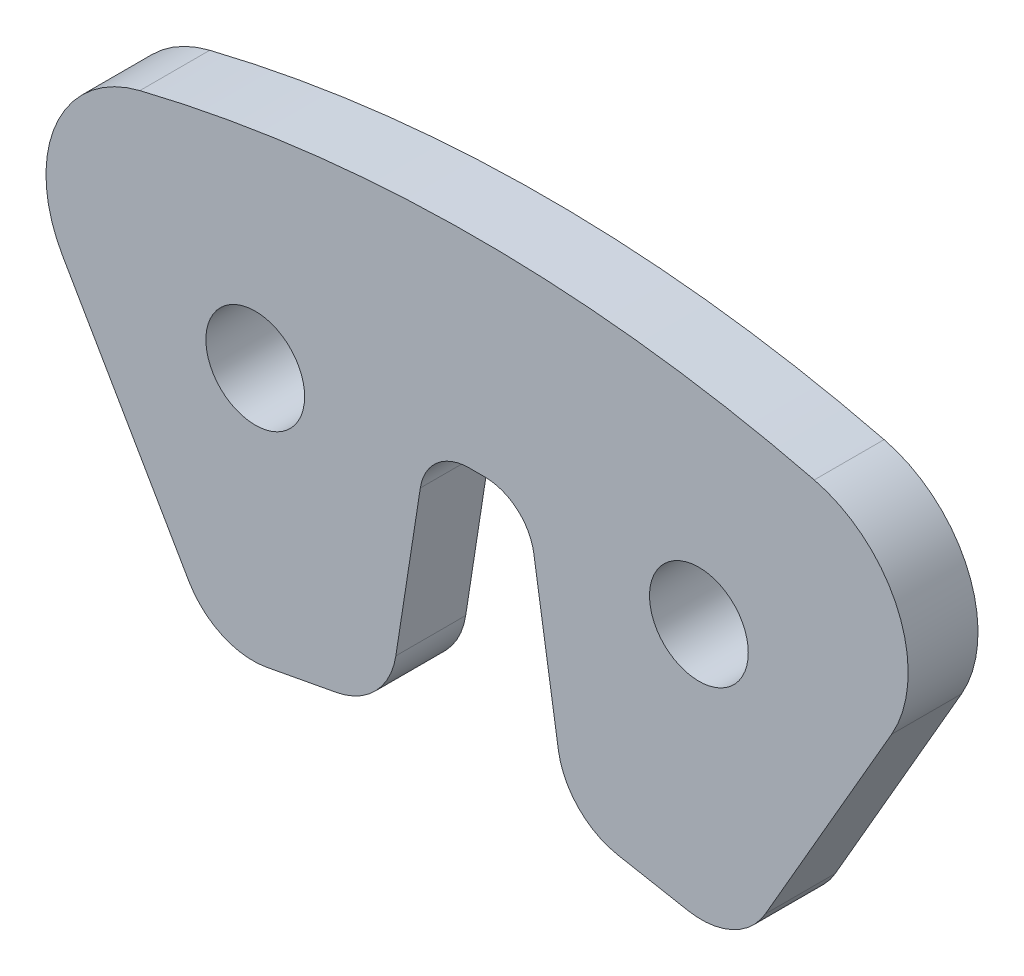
from build123d import *

# Parameters (mm, degrees)
SKETCH_2_R      = 1.06
EXTRUDE_1_DEPTH = 0.75
FILLET_1_R      = 2.65
FILLET_2_R      = 1.59
FILLET_3_R      = 1.06


with BuildPart() as part:
    # Sketch 2 → Extrude 1 (new, symmetric)
    with BuildSketch(Plane.XY):
        with BuildLine():
            Line((1.916731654, 20.523889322), (5.626784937, 19.830360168))
            Line((5.626784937, 19.830360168), (8.119880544, 24.148528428))
            Line((8.119880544, 24.148528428), (10.560448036, 28.375715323))
            ThreePointArc((10.560448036, 28.375715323), (0, 30.277124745), (-10.560448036, 28.375715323))
            Line((-10.560448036, 28.375715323), (-5.626784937, 19.830360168))
            Line((-5.626784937, 19.830360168), (-1.916731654, 20.523889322))
            Line((-1.916731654, 20.523889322), (-1.082856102, 25.895804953))
            ThreePointArc((-1.082856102, 25.895804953), (0, 25.91843536), (1.082856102, 25.895804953))
            Line((1.082856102, 25.895804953), (1.916731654, 20.523889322))
        make_face()
        with Locations((-4.7625, 25.477124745)):
            Circle(SKETCH_2_R, mode=Mode.SUBTRACT)
        with Locations((4.7625, 25.477124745)):
            Circle(SKETCH_2_R, mode=Mode.SUBTRACT)
    extrude(amount=EXTRUDE_1_DEPTH, both=True)

    # Fillet 1
    fillet_1_edges = [part.edges().sort_by_distance(p)[0] for p in [
        (-10.560448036, 28.375715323, 0),
        (10.560448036, 28.375715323, 0),
    ]]
    fillet(fillet_1_edges, radius=FILLET_1_R)

    # Fillet 2
    fillet_2_edges = [part.edges().sort_by_distance(p)[0] for p in [
        (-1.916731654, 20.523889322, 0),
        (-5.626784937, 19.830360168, 0),
        (5.626784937, 19.830360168, 0),
        (1.916731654, 20.523889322, 0),
    ]]
    fillet(fillet_2_edges, radius=FILLET_2_R)

    # Fillet 3
    fillet_3_edges = [part.edges().sort_by_distance(p)[0] for p in [
        (1.082856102, 25.895804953, 0),
        (-1.082856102, 25.895804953, 0),
    ]]
    fillet(fillet_3_edges, radius=FILLET_3_R)


solid = part.part
